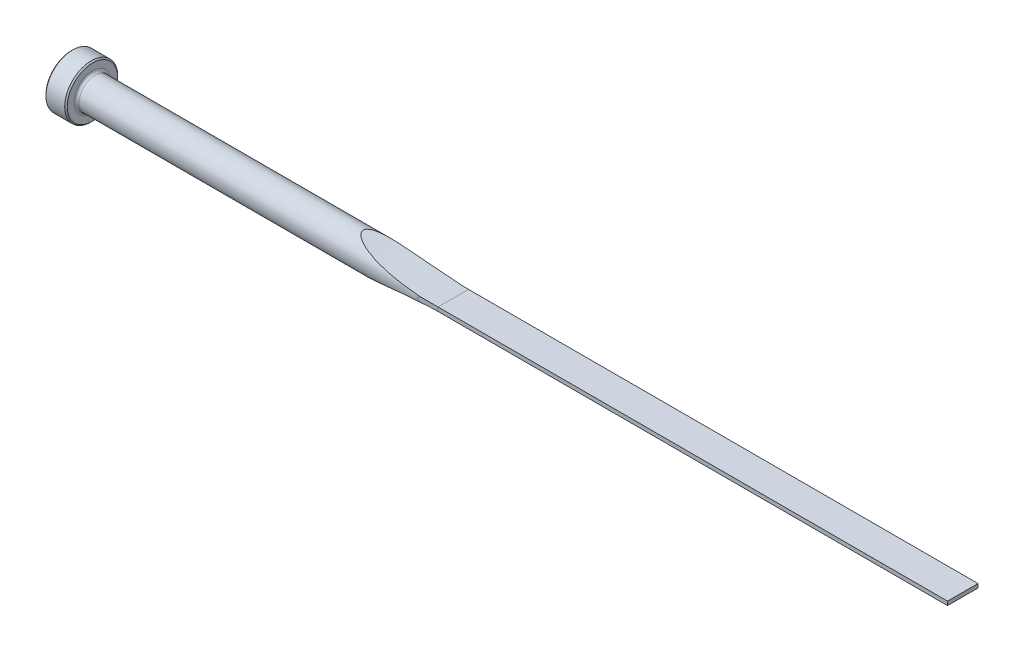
from build123d import *

# Parameters (mm, degrees)
CUT_EXTRUDE1_DEPTH = 267.936130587
CUT_EXTRUDE2_DEPTH = 267.936130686
FILLET1_R          = 0.762
CHAMFER1_SIZE      = 0.381


with BuildPart() as part:
    # Sketch1 → Revolve1 (revolve)
    with BuildSketch(Plane.XY, mode=Mode.PRIVATE) as revolve1_sk:
        Polygon((0, 0), (0, 7.9375), (6.35, 7.9375), (6.35, 4.7625), (266.7, 4.7625), (266.7, 0), align=None)
    revolve(revolve1_sk.sketch.rotate(Axis((0, 0, 0), (1, 0, 0)), 90), axis=Axis((0, 0, 0), (1, 0, 0)))

    # Sketch2 → Cut-Extrude1 (cut, symmetric)
    with BuildSketch(Plane.XY):
        with BuildLine():
            Line((266.7, 4.7625), (266.7, 0.5842))
            Line((266.7, 0.5842), (114.3, 0.5842))
            ThreePointArc((114.3, 0.5842), (100.671888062, 1.634985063), (87.365940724, 4.7625))
            Line((87.365940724, 4.7625), (266.7, 4.7625))
        make_face()
    cut_extrude1 = extrude(amount=CUT_EXTRUDE1_DEPTH, both=True, mode=Mode.SUBTRACT)

    # Mirror1: Cut-Extrude1 across plane
    add(cut_extrude1.mirror(Plane.ZX), mode=Mode.SUBTRACT)

    # Sketch3 → Cut-Extrude2 (cut, symmetric)
    with BuildSketch(Plane(origin=(0, 0, 0), x_dir=(1, 0, 0), z_dir=(0, 1, 0))):
        with BuildLine():
            Line((266.7, 4.7625), (266.7, 4.5593))
            Line((266.7, 4.5593), (114.3, 4.5593))
            ThreePointArc((114.3, 4.5593), (111.29463147, 4.610114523), (108.292698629, 4.7625))
            Line((108.292698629, 4.7625), (266.7, 4.7625))
        make_face()
    cut_extrude2 = extrude(amount=CUT_EXTRUDE2_DEPTH, both=True, mode=Mode.SUBTRACT)

    # Mirror2: Cut-Extrude2 across plane
    add(cut_extrude2.mirror(Plane.XY), mode=Mode.SUBTRACT)

    # Fillet1
    fillet1_edges = [part.edges().sort_by_distance(p)[0] for p in [
        (6.35, 0, -4.7625),
    ]]
    fillet(fillet1_edges, radius=FILLET1_R)

    # Chamfer1
    chamfer1_edges = [part.edges().sort_by_distance(p)[0] for p in [
        (6.35, 0, -7.9375),
        (0, 0, -7.9375),
    ]]
    chamfer(chamfer1_edges, length=CHAMFER1_SIZE)


solid = part.part
